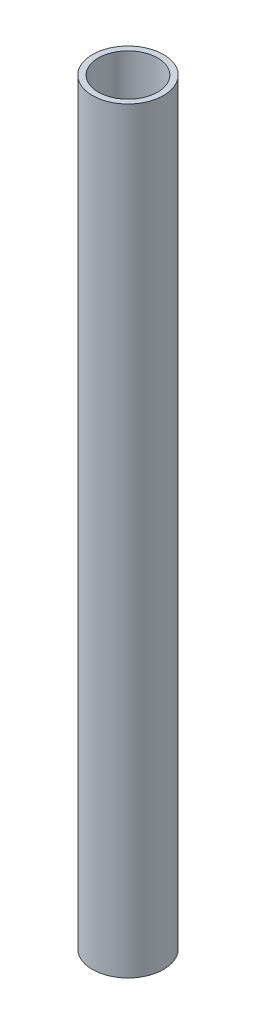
ISO-10303-21;
HEADER;
FILE_DESCRIPTION(('STEP AP214'),'2;1');
FILE_NAME('part.step','',(''),(''),'','','');
FILE_SCHEMA(('AUTOMOTIVE_DESIGN { 1 0 10303 214 1 1 1 1 }'));
ENDSEC;
DATA;
#1=APPLICATION_CONTEXT('core data for automotive mechanical design processes');
#2=APPLICATION_PROTOCOL_DEFINITION('international standard','automotive_design',2000,#1);
#3=PRODUCT_CONTEXT('',#1,'mechanical');
#4=PRODUCT('Part','Part','',(#3));
#5=PRODUCT_RELATED_PRODUCT_CATEGORY('part','',(#4));
#6=PRODUCT_DEFINITION_FORMATION('','',#4);
#7=PRODUCT_DEFINITION_CONTEXT('part definition',#1,'design');
#8=PRODUCT_DEFINITION('design','',#6,#7);
#9=PRODUCT_DEFINITION_SHAPE('','',#8);
#10=(LENGTH_UNIT() NAMED_UNIT(*) SI_UNIT(.MILLI.,.METRE.));
#11=(NAMED_UNIT(*) PLANE_ANGLE_UNIT() SI_UNIT($,.RADIAN.));
#12=(NAMED_UNIT(*) SI_UNIT($,.STERADIAN.) SOLID_ANGLE_UNIT());
#13=UNCERTAINTY_MEASURE_WITH_UNIT(LENGTH_MEASURE(1.E-05),#10,'distance_accuracy_value','');
#14=(GEOMETRIC_REPRESENTATION_CONTEXT(3) GLOBAL_UNCERTAINTY_ASSIGNED_CONTEXT((#13)) GLOBAL_UNIT_ASSIGNED_CONTEXT((#10,
#11,#12)) REPRESENTATION_CONTEXT('',''));
#15=CARTESIAN_POINT('',(0.,0.,0.));
#16=DIRECTION('',(0.,0.,1.));
#17=DIRECTION('',(1.,0.,0.));
#18=AXIS2_PLACEMENT_3D('',#15,#16,#17);
#19=CARTESIAN_POINT('',(0.,355.6,0.));
#20=DIRECTION('',(0.,1.,0.));
#21=DIRECTION('',(0.,0.,1.));
#22=AXIS2_PLACEMENT_3D('',#19,#20,#21);
#23=PLANE('',#22);
#24=CARTESIAN_POINT('',(0.,355.6,0.));
#25=DIRECTION('',(0.,1.,0.));
#26=DIRECTION('',(0.,0.,1.));
#27=AXIS2_PLACEMENT_3D('',#24,#25,#26);
#28=CIRCLE('',#27,16.7005);
#29=CARTESIAN_POINT('',(0.,355.6,16.7005));
#30=VERTEX_POINT('',#29);
#31=EDGE_CURVE('E10',#30,#30,#28,.T.);
#32=ORIENTED_EDGE('',*,*,#31,.T.);
#33=EDGE_LOOP('',(#32));
#34=FACE_BOUND('',#33,.T.);
#35=CARTESIAN_POINT('',(0.,355.6,0.));
#36=DIRECTION('',(0.,1.,0.));
#37=DIRECTION('',(0.,0.,1.));
#38=AXIS2_PLACEMENT_3D('',#35,#36,#37);
#39=CIRCLE('',#38,13.9319);
#40=CARTESIAN_POINT('',(0.,355.6,13.9319));
#41=VERTEX_POINT('',#40);
#42=EDGE_CURVE('E42',#41,#41,#39,.T.);
#43=ORIENTED_EDGE('',*,*,#42,.F.);
#44=EDGE_LOOP('',(#43));
#45=FACE_BOUND('',#44,.T.);
#46=ADVANCED_FACE('F31',(#34,#45),#23,.T.);
#47=CARTESIAN_POINT('',(0.,0.,0.));
#48=DIRECTION('',(0.,1.,0.));
#49=DIRECTION('',(0.,0.,1.));
#50=AXIS2_PLACEMENT_3D('',#47,#48,#49);
#51=PLANE('',#50);
#52=CARTESIAN_POINT('',(0.,0.,0.));
#53=DIRECTION('',(0.,1.,0.));
#54=DIRECTION('',(0.,0.,1.));
#55=AXIS2_PLACEMENT_3D('',#52,#53,#54);
#56=CIRCLE('',#55,16.7005);
#57=CARTESIAN_POINT('',(0.,0.,16.7005));
#58=VERTEX_POINT('',#57);
#59=EDGE_CURVE('E38',#58,#58,#56,.T.);
#60=ORIENTED_EDGE('',*,*,#59,.F.);
#61=EDGE_LOOP('',(#60));
#62=FACE_BOUND('',#61,.T.);
#63=CARTESIAN_POINT('',(0.,0.,0.));
#64=DIRECTION('',(0.,1.,0.));
#65=DIRECTION('',(0.,0.,1.));
#66=AXIS2_PLACEMENT_3D('',#63,#64,#65);
#67=CIRCLE('',#66,13.9319);
#68=CARTESIAN_POINT('',(0.,0.,13.9319));
#69=VERTEX_POINT('',#68);
#70=EDGE_CURVE('E46',#69,#69,#67,.T.);
#71=ORIENTED_EDGE('',*,*,#70,.T.);
#72=EDGE_LOOP('',(#71));
#73=FACE_BOUND('',#72,.T.);
#74=ADVANCED_FACE('F52',(#62,#73),#51,.F.);
#75=CARTESIAN_POINT('',(0.,355.6,0.));
#76=DIRECTION('',(0.,-1.,0.));
#77=DIRECTION('',(0.,0.,-1.));
#78=AXIS2_PLACEMENT_3D('',#75,#76,#77);
#79=CYLINDRICAL_SURFACE('',#78,16.7005);
#80=ORIENTED_EDGE('',*,*,#31,.F.);
#81=EDGE_LOOP('',(#80));
#82=FACE_BOUND('',#81,.T.);
#83=ORIENTED_EDGE('',*,*,#59,.T.);
#84=EDGE_LOOP('',(#83));
#85=FACE_BOUND('',#84,.T.);
#86=ADVANCED_FACE('F33',(#82,#85),#79,.T.);
#87=CARTESIAN_POINT('',(0.,355.6,0.));
#88=DIRECTION('',(0.,-1.,0.));
#89=DIRECTION('',(0.,0.,-1.));
#90=AXIS2_PLACEMENT_3D('',#87,#88,#89);
#91=CYLINDRICAL_SURFACE('',#90,13.9319);
#92=ORIENTED_EDGE('',*,*,#42,.T.);
#93=EDGE_LOOP('',(#92));
#94=FACE_BOUND('',#93,.T.);
#95=ORIENTED_EDGE('',*,*,#70,.F.);
#96=EDGE_LOOP('',(#95));
#97=FACE_BOUND('',#96,.T.);
#98=ADVANCED_FACE('F54',(#94,#97),#91,.F.);
#99=CLOSED_SHELL('',(#46,#74,#86,#98));
#100=MANIFOLD_SOLID_BREP('B2',#99);
#101=ADVANCED_BREP_SHAPE_REPRESENTATION('',(#18,#100),#14);
#102=SHAPE_DEFINITION_REPRESENTATION(#9,#101);
ENDSEC;
END-ISO-10303-21;
